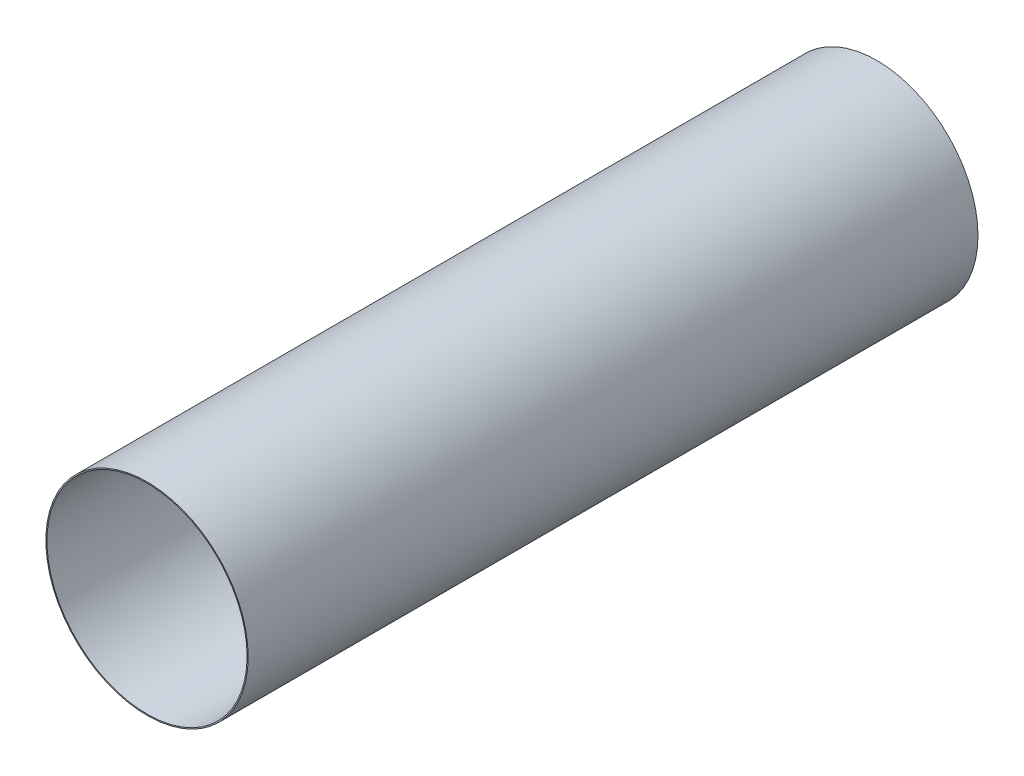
ISO-10303-21;
HEADER;
FILE_DESCRIPTION(('STEP AP214'),'2;1');
FILE_NAME('part.step','',(''),(''),'','','');
FILE_SCHEMA(('AUTOMOTIVE_DESIGN { 1 0 10303 214 1 1 1 1 }'));
ENDSEC;
DATA;
#1=APPLICATION_CONTEXT('core data for automotive mechanical design processes');
#2=APPLICATION_PROTOCOL_DEFINITION('international standard','automotive_design',2000,#1);
#3=PRODUCT_CONTEXT('',#1,'mechanical');
#4=PRODUCT('Part','Part','',(#3));
#5=PRODUCT_RELATED_PRODUCT_CATEGORY('part','',(#4));
#6=PRODUCT_DEFINITION_FORMATION('','',#4);
#7=PRODUCT_DEFINITION_CONTEXT('part definition',#1,'design');
#8=PRODUCT_DEFINITION('design','',#6,#7);
#9=PRODUCT_DEFINITION_SHAPE('','',#8);
#10=(LENGTH_UNIT() NAMED_UNIT(*) SI_UNIT(.MILLI.,.METRE.));
#11=(NAMED_UNIT(*) PLANE_ANGLE_UNIT() SI_UNIT($,.RADIAN.));
#12=(NAMED_UNIT(*) SI_UNIT($,.STERADIAN.) SOLID_ANGLE_UNIT());
#13=UNCERTAINTY_MEASURE_WITH_UNIT(LENGTH_MEASURE(1.E-05),#10,'distance_accuracy_value','');
#14=(GEOMETRIC_REPRESENTATION_CONTEXT(3) GLOBAL_UNCERTAINTY_ASSIGNED_CONTEXT((#13)) GLOBAL_UNIT_ASSIGNED_CONTEXT((#10,
#11,#12)) REPRESENTATION_CONTEXT('',''));
#15=CARTESIAN_POINT('',(0.,0.,0.));
#16=DIRECTION('',(0.,0.,1.));
#17=DIRECTION('',(1.,0.,0.));
#18=AXIS2_PLACEMENT_3D('',#15,#16,#17);
#19=CARTESIAN_POINT('',(0.,0.,3300.));
#20=DIRECTION('',(0.,0.,1.));
#21=DIRECTION('',(1.,0.,0.));
#22=AXIS2_PLACEMENT_3D('',#19,#20,#21);
#23=PLANE('',#22);
#24=CARTESIAN_POINT('',(0.,0.,3300.));
#25=DIRECTION('',(0.,0.,1.));
#26=DIRECTION('',(1.,0.,0.));
#27=AXIS2_PLACEMENT_3D('',#24,#25,#26);
#28=CIRCLE('',#27,457.5);
#29=CARTESIAN_POINT('',(457.5,0.,3300.));
#30=VERTEX_POINT('',#29);
#31=EDGE_CURVE('E10',#30,#30,#28,.T.);
#32=ORIENTED_EDGE('',*,*,#31,.T.);
#33=EDGE_LOOP('',(#32));
#34=FACE_BOUND('',#33,.T.);
#35=CARTESIAN_POINT('',(0.,0.,3300.));
#36=DIRECTION('',(0.,0.,1.));
#37=DIRECTION('',(1.,0.,0.));
#38=AXIS2_PLACEMENT_3D('',#35,#36,#37);
#39=CIRCLE('',#38,452.5);
#40=CARTESIAN_POINT('',(452.5,0.,3300.));
#41=VERTEX_POINT('',#40);
#42=EDGE_CURVE('E43',#41,#41,#39,.T.);
#43=ORIENTED_EDGE('',*,*,#42,.F.);
#44=EDGE_LOOP('',(#43));
#45=FACE_BOUND('',#44,.T.);
#46=ADVANCED_FACE('F32',(#34,#45),#23,.T.);
#47=CARTESIAN_POINT('',(0.,0.,0.));
#48=DIRECTION('',(0.,0.,1.));
#49=DIRECTION('',(1.,0.,0.));
#50=AXIS2_PLACEMENT_3D('',#47,#48,#49);
#51=PLANE('',#50);
#52=CARTESIAN_POINT('',(0.,0.,0.));
#53=DIRECTION('',(0.,0.,1.));
#54=DIRECTION('',(1.,0.,0.));
#55=AXIS2_PLACEMENT_3D('',#52,#53,#54);
#56=CIRCLE('',#55,457.5);
#57=CARTESIAN_POINT('',(457.5,0.,0.));
#58=VERTEX_POINT('',#57);
#59=EDGE_CURVE('E36',#58,#58,#56,.T.);
#60=ORIENTED_EDGE('',*,*,#59,.F.);
#61=EDGE_LOOP('',(#60));
#62=FACE_BOUND('',#61,.T.);
#63=CARTESIAN_POINT('',(0.,0.,0.));
#64=DIRECTION('',(0.,0.,1.));
#65=DIRECTION('',(1.,0.,0.));
#66=AXIS2_PLACEMENT_3D('',#63,#64,#65);
#67=CIRCLE('',#66,452.5);
#68=CARTESIAN_POINT('',(452.5,0.,0.));
#69=VERTEX_POINT('',#68);
#70=EDGE_CURVE('E45',#69,#69,#67,.T.);
#71=ORIENTED_EDGE('',*,*,#70,.T.);
#72=EDGE_LOOP('',(#71));
#73=FACE_BOUND('',#72,.T.);
#74=ADVANCED_FACE('F55',(#62,#73),#51,.F.);
#75=CARTESIAN_POINT('',(0.,0.,3300.));
#76=DIRECTION('',(0.,0.,-1.));
#77=DIRECTION('',(-1.,0.,0.));
#78=AXIS2_PLACEMENT_3D('',#75,#76,#77);
#79=CYLINDRICAL_SURFACE('',#78,457.5);
#80=ORIENTED_EDGE('',*,*,#31,.F.);
#81=EDGE_LOOP('',(#80));
#82=FACE_BOUND('',#81,.T.);
#83=ORIENTED_EDGE('',*,*,#59,.T.);
#84=EDGE_LOOP('',(#83));
#85=FACE_BOUND('',#84,.T.);
#86=ADVANCED_FACE('F34',(#82,#85),#79,.T.);
#87=CARTESIAN_POINT('',(0.,0.,3300.));
#88=DIRECTION('',(0.,0.,-1.));
#89=DIRECTION('',(-1.,0.,0.));
#90=AXIS2_PLACEMENT_3D('',#87,#88,#89);
#91=CYLINDRICAL_SURFACE('',#90,452.5);
#92=ORIENTED_EDGE('',*,*,#42,.T.);
#93=EDGE_LOOP('',(#92));
#94=FACE_BOUND('',#93,.T.);
#95=ORIENTED_EDGE('',*,*,#70,.F.);
#96=EDGE_LOOP('',(#95));
#97=FACE_BOUND('',#96,.T.);
#98=ADVANCED_FACE('F51',(#94,#97),#91,.F.);
#99=CLOSED_SHELL('',(#46,#74,#86,#98));
#100=MANIFOLD_SOLID_BREP('B2',#99);
#101=ADVANCED_BREP_SHAPE_REPRESENTATION('',(#18,#100),#14);
#102=SHAPE_DEFINITION_REPRESENTATION(#9,#101);
ENDSEC;
END-ISO-10303-21;
